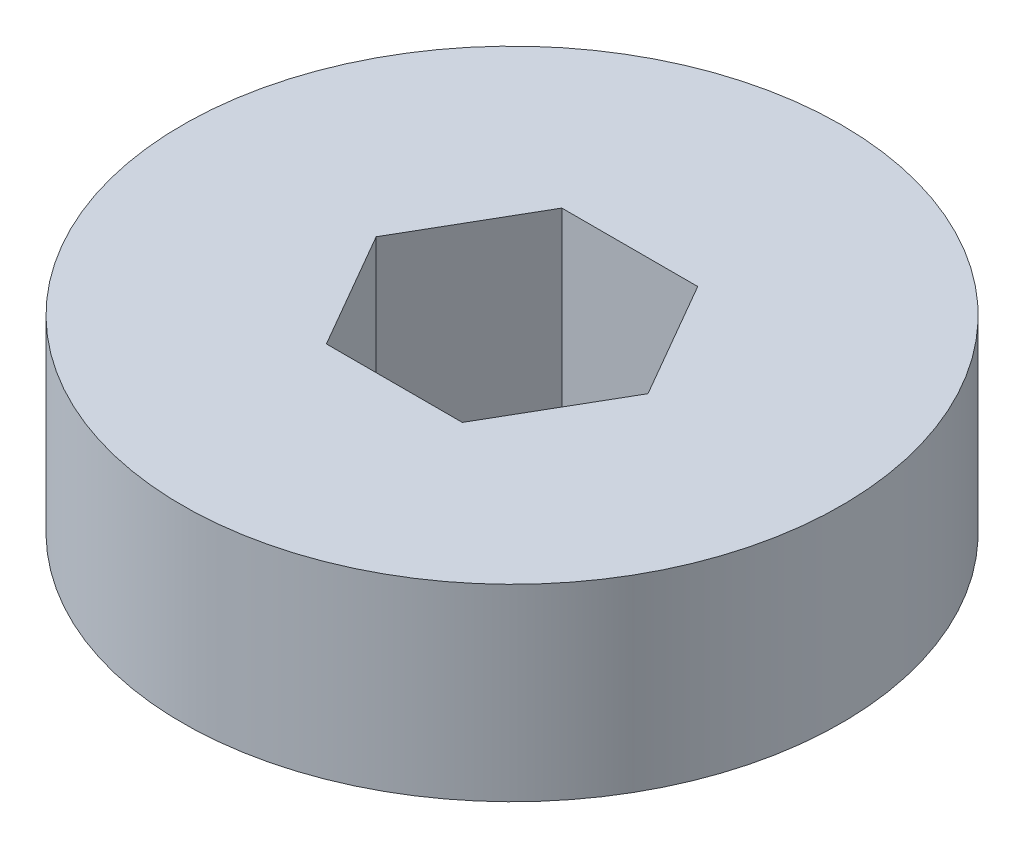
ISO-10303-21;
HEADER;
FILE_DESCRIPTION(('STEP AP214'),'2;1');
FILE_NAME('part.step','',(''),(''),'','','');
FILE_SCHEMA(('AUTOMOTIVE_DESIGN { 1 0 10303 214 1 1 1 1 }'));
ENDSEC;
DATA;
#1=APPLICATION_CONTEXT('core data for automotive mechanical design processes');
#2=APPLICATION_PROTOCOL_DEFINITION('international standard','automotive_design',2000,#1);
#3=PRODUCT_CONTEXT('',#1,'mechanical');
#4=PRODUCT('Part','Part','',(#3));
#5=PRODUCT_RELATED_PRODUCT_CATEGORY('part','',(#4));
#6=PRODUCT_DEFINITION_FORMATION('','',#4);
#7=PRODUCT_DEFINITION_CONTEXT('part definition',#1,'design');
#8=PRODUCT_DEFINITION('design','',#6,#7);
#9=PRODUCT_DEFINITION_SHAPE('','',#8);
#10=(LENGTH_UNIT() NAMED_UNIT(*) SI_UNIT(.MILLI.,.METRE.));
#11=(NAMED_UNIT(*) PLANE_ANGLE_UNIT() SI_UNIT($,.RADIAN.));
#12=(NAMED_UNIT(*) SI_UNIT($,.STERADIAN.) SOLID_ANGLE_UNIT());
#13=UNCERTAINTY_MEASURE_WITH_UNIT(LENGTH_MEASURE(1.E-05),#10,'distance_accuracy_value','');
#14=(GEOMETRIC_REPRESENTATION_CONTEXT(3) GLOBAL_UNCERTAINTY_ASSIGNED_CONTEXT((#13)) GLOBAL_UNIT_ASSIGNED_CONTEXT((#10,
#11,#12)) REPRESENTATION_CONTEXT('',''));
#15=CARTESIAN_POINT('',(0.,0.,0.));
#16=DIRECTION('',(0.,0.,1.));
#17=DIRECTION('',(1.,0.,0.));
#18=AXIS2_PLACEMENT_3D('',#15,#16,#17);
#19=CARTESIAN_POINT('',(56.,154.,66.));
#20=DIRECTION('',(0.,-1.,0.));
#21=DIRECTION('',(0.,0.,-1.));
#22=AXIS2_PLACEMENT_3D('',#19,#20,#21);
#23=CYLINDRICAL_SURFACE('',#22,7.);
#24=CARTESIAN_POINT('',(56.,150.,66.));
#25=DIRECTION('',(0.,-1.,0.));
#26=DIRECTION('',(0.,0.,-1.));
#27=AXIS2_PLACEMENT_3D('',#24,#25,#26);
#28=CIRCLE('',#27,7.);
#29=CARTESIAN_POINT('',(56.,150.,59.));
#30=VERTEX_POINT('',#29);
#31=EDGE_CURVE('E102',#30,#30,#28,.T.);
#32=ORIENTED_EDGE('',*,*,#31,.F.);
#33=EDGE_LOOP('',(#32));
#34=FACE_BOUND('',#33,.T.);
#35=CARTESIAN_POINT('',(56.,154.,66.));
#36=DIRECTION('',(0.,-1.,0.));
#37=DIRECTION('',(0.,0.,-1.));
#38=AXIS2_PLACEMENT_3D('',#35,#36,#37);
#39=CIRCLE('',#38,7.);
#40=CARTESIAN_POINT('',(56.,154.,59.));
#41=VERTEX_POINT('',#40);
#42=EDGE_CURVE('E112',#41,#41,#39,.F.);
#43=ORIENTED_EDGE('',*,*,#42,.F.);
#44=EDGE_LOOP('',(#43));
#45=FACE_BOUND('',#44,.T.);
#46=ADVANCED_FACE('F16',(#34,#45),#23,.T.);
#47=CARTESIAN_POINT('',(53.8349364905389,152.,67.25));
#48=DIRECTION('',(0.866025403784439,0.,-0.499999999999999));
#49=DIRECTION('',(-0.499999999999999,0.,-0.866025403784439));
#50=AXIS2_PLACEMENT_3D('',#47,#48,#49);
#51=PLANE('',#50);
#52=DIRECTION('',(0.,1.,0.));
#53=VECTOR('',#52,1.);
#54=CARTESIAN_POINT('',(53.1132486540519,152.,66.));
#55=LINE('',#54,#53);
#56=CARTESIAN_POINT('',(53.1132486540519,154.,66.));
#57=VERTEX_POINT('',#56);
#58=CARTESIAN_POINT('',(53.1132486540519,150.,66.));
#59=VERTEX_POINT('',#58);
#60=EDGE_CURVE('E87',#57,#59,#55,.F.);
#61=ORIENTED_EDGE('',*,*,#60,.F.);
#62=DIRECTION('',(-0.499999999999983,0.,-0.866025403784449));
#63=VECTOR('',#62,1.);
#64=CARTESIAN_POINT('',(54.5566243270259,154.,68.5));
#65=LINE('',#64,#63);
#66=CARTESIAN_POINT('',(54.5566243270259,154.,68.5));
#67=VERTEX_POINT('',#66);
#68=EDGE_CURVE('E68',#67,#57,#65,.T.);
#69=ORIENTED_EDGE('',*,*,#68,.F.);
#70=DIRECTION('',(0.,1.,0.));
#71=VECTOR('',#70,1.);
#72=CARTESIAN_POINT('',(54.5566243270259,152.,68.5));
#73=LINE('',#72,#71);
#74=CARTESIAN_POINT('',(54.5566243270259,150.,68.5));
#75=VERTEX_POINT('',#74);
#76=EDGE_CURVE('E89',#75,#67,#73,.T.);
#77=ORIENTED_EDGE('',*,*,#76,.F.);
#78=DIRECTION('',(0.499999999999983,0.,0.866025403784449));
#79=VECTOR('',#78,1.);
#80=CARTESIAN_POINT('',(53.1132486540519,150.,66.));
#81=LINE('',#80,#79);
#82=EDGE_CURVE('E84',#59,#75,#81,.T.);
#83=ORIENTED_EDGE('',*,*,#82,.F.);
#84=EDGE_LOOP('',(#61,#69,#77,#83));
#85=FACE_BOUND('',#84,.T.);
#86=ADVANCED_FACE('F86',(#85),#51,.T.);
#87=CARTESIAN_POINT('',(53.8349364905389,152.,64.75));
#88=DIRECTION('',(0.866025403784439,0.,0.499999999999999));
#89=DIRECTION('',(0.499999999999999,0.,-0.866025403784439));
#90=AXIS2_PLACEMENT_3D('',#87,#88,#89);
#91=PLANE('',#90);
#92=DIRECTION('',(0.,1.,0.));
#93=VECTOR('',#92,1.);
#94=CARTESIAN_POINT('',(54.5566243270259,152.,63.5));
#95=LINE('',#94,#93);
#96=CARTESIAN_POINT('',(54.5566243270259,154.,63.5));
#97=VERTEX_POINT('',#96);
#98=CARTESIAN_POINT('',(54.5566243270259,150.,63.5));
#99=VERTEX_POINT('',#98);
#100=EDGE_CURVE('E79',#97,#99,#95,.F.);
#101=ORIENTED_EDGE('',*,*,#100,.F.);
#102=DIRECTION('',(0.499999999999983,0.,-0.866025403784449));
#103=VECTOR('',#102,1.);
#104=CARTESIAN_POINT('',(53.1132486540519,154.,66.));
#105=LINE('',#104,#103);
#106=EDGE_CURVE('E97',#57,#97,#105,.T.);
#107=ORIENTED_EDGE('',*,*,#106,.F.);
#108=ORIENTED_EDGE('',*,*,#60,.T.);
#109=DIRECTION('',(-0.499999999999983,0.,0.866025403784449));
#110=VECTOR('',#109,1.);
#111=CARTESIAN_POINT('',(54.5566243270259,150.,63.5));
#112=LINE('',#111,#110);
#113=EDGE_CURVE('E94',#99,#59,#112,.T.);
#114=ORIENTED_EDGE('',*,*,#113,.F.);
#115=EDGE_LOOP('',(#101,#107,#108,#114));
#116=FACE_BOUND('',#115,.T.);
#117=ADVANCED_FACE('F93',(#116),#91,.T.);
#118=CARTESIAN_POINT('',(56.,152.,68.5));
#119=DIRECTION('',(0.,0.,-1.));
#120=DIRECTION('',(-1.,0.,0.));
#121=AXIS2_PLACEMENT_3D('',#118,#119,#120);
#122=PLANE('',#121);
#123=ORIENTED_EDGE('',*,*,#76,.T.);
#124=DIRECTION('',(1.,0.,0.));
#125=VECTOR('',#124,1.);
#126=CARTESIAN_POINT('',(56.,154.,68.5));
#127=LINE('',#126,#125);
#128=CARTESIAN_POINT('',(57.4433756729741,154.,68.5));
#129=VERTEX_POINT('',#128);
#130=EDGE_CURVE('E114',#129,#67,#127,.F.);
#131=ORIENTED_EDGE('',*,*,#130,.F.);
#132=DIRECTION('',(0.,1.,0.));
#133=VECTOR('',#132,1.);
#134=CARTESIAN_POINT('',(57.4433756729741,152.,68.5));
#135=LINE('',#134,#133);
#136=CARTESIAN_POINT('',(57.4433756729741,150.,68.5));
#137=VERTEX_POINT('',#136);
#138=EDGE_CURVE('E55',#137,#129,#135,.T.);
#139=ORIENTED_EDGE('',*,*,#138,.F.);
#140=DIRECTION('',(1.,0.,0.));
#141=VECTOR('',#140,1.);
#142=CARTESIAN_POINT('',(56.,150.,68.5));
#143=LINE('',#142,#141);
#144=EDGE_CURVE('E75',#75,#137,#143,.T.);
#145=ORIENTED_EDGE('',*,*,#144,.F.);
#146=EDGE_LOOP('',(#123,#131,#139,#145));
#147=FACE_BOUND('',#146,.T.);
#148=ADVANCED_FACE('F162',(#147),#122,.T.);
#149=CARTESIAN_POINT('',(56.,152.,63.5));
#150=DIRECTION('',(0.,0.,1.));
#151=DIRECTION('',(1.,0.,0.));
#152=AXIS2_PLACEMENT_3D('',#149,#150,#151);
#153=PLANE('',#152);
#154=DIRECTION('',(0.,1.,0.));
#155=VECTOR('',#154,1.);
#156=CARTESIAN_POINT('',(57.4433756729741,152.,63.5));
#157=LINE('',#156,#155);
#158=CARTESIAN_POINT('',(57.4433756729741,154.,63.5));
#159=VERTEX_POINT('',#158);
#160=CARTESIAN_POINT('',(57.4433756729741,150.,63.5));
#161=VERTEX_POINT('',#160);
#162=EDGE_CURVE('E49',#159,#161,#157,.F.);
#163=ORIENTED_EDGE('',*,*,#162,.F.);
#164=DIRECTION('',(1.,0.,0.));
#165=VECTOR('',#164,1.);
#166=CARTESIAN_POINT('',(56.,154.,63.5));
#167=LINE('',#166,#165);
#168=EDGE_CURVE('E118',#97,#159,#167,.T.);
#169=ORIENTED_EDGE('',*,*,#168,.F.);
#170=ORIENTED_EDGE('',*,*,#100,.T.);
#171=DIRECTION('',(1.,0.,0.));
#172=VECTOR('',#171,1.);
#173=CARTESIAN_POINT('',(56.,150.,63.5));
#174=LINE('',#173,#172);
#175=EDGE_CURVE('E101',#161,#99,#174,.F.);
#176=ORIENTED_EDGE('',*,*,#175,.F.);
#177=EDGE_LOOP('',(#163,#169,#170,#176));
#178=FACE_BOUND('',#177,.T.);
#179=ADVANCED_FACE('F156',(#178),#153,.T.);
#180=CARTESIAN_POINT('',(56.,150.,66.));
#181=DIRECTION('',(0.,-1.,0.));
#182=DIRECTION('',(0.,0.,-1.));
#183=AXIS2_PLACEMENT_3D('',#180,#181,#182);
#184=PLANE('',#183);
#185=ORIENTED_EDGE('',*,*,#31,.T.);
#186=EDGE_LOOP('',(#185));
#187=FACE_BOUND('',#186,.T.);
#188=ORIENTED_EDGE('',*,*,#175,.T.);
#189=ORIENTED_EDGE('',*,*,#113,.T.);
#190=ORIENTED_EDGE('',*,*,#82,.T.);
#191=ORIENTED_EDGE('',*,*,#144,.T.);
#192=DIRECTION('',(-0.499999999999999,0.,0.866025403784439));
#193=VECTOR('',#192,1.);
#194=CARTESIAN_POINT('',(58.1650635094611,150.,67.25));
#195=LINE('',#194,#193);
#196=CARTESIAN_POINT('',(58.8867513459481,150.,66.));
#197=VERTEX_POINT('',#196);
#198=EDGE_CURVE('E105',#197,#137,#195,.T.);
#199=ORIENTED_EDGE('',*,*,#198,.F.);
#200=DIRECTION('',(0.499999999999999,0.,0.866025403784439));
#201=VECTOR('',#200,1.);
#202=CARTESIAN_POINT('',(58.1650635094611,150.,64.75));
#203=LINE('',#202,#201);
#204=EDGE_CURVE('E124',#161,#197,#203,.T.);
#205=ORIENTED_EDGE('',*,*,#204,.F.);
#206=EDGE_LOOP('',(#188,#189,#190,#191,#199,#205));
#207=FACE_BOUND('',#206,.T.);
#208=ADVANCED_FACE('F99',(#187,#207),#184,.T.);
#209=CARTESIAN_POINT('',(58.1650635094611,152.,67.25));
#210=DIRECTION('',(-0.866025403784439,0.,-0.499999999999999));
#211=DIRECTION('',(-0.499999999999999,0.,0.866025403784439));
#212=AXIS2_PLACEMENT_3D('',#209,#210,#211);
#213=PLANE('',#212);
#214=ORIENTED_EDGE('',*,*,#138,.T.);
#215=DIRECTION('',(-0.499999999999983,0.,0.866025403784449));
#216=VECTOR('',#215,1.);
#217=CARTESIAN_POINT('',(58.8867513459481,154.,66.));
#218=LINE('',#217,#216);
#219=CARTESIAN_POINT('',(58.8867513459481,154.,66.));
#220=VERTEX_POINT('',#219);
#221=EDGE_CURVE('E35',#220,#129,#218,.T.);
#222=ORIENTED_EDGE('',*,*,#221,.F.);
#223=DIRECTION('',(0.,1.,0.));
#224=VECTOR('',#223,1.);
#225=CARTESIAN_POINT('',(58.8867513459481,152.,66.));
#226=LINE('',#225,#224);
#227=EDGE_CURVE('E26',#197,#220,#226,.T.);
#228=ORIENTED_EDGE('',*,*,#227,.F.);
#229=ORIENTED_EDGE('',*,*,#198,.T.);
#230=EDGE_LOOP('',(#214,#222,#228,#229));
#231=FACE_BOUND('',#230,.T.);
#232=ADVANCED_FACE('F149',(#231),#213,.T.);
#233=CARTESIAN_POINT('',(56.,154.,66.));
#234=DIRECTION('',(0.,1.,0.));
#235=DIRECTION('',(0.,0.,1.));
#236=AXIS2_PLACEMENT_3D('',#233,#234,#235);
#237=PLANE('',#236);
#238=ORIENTED_EDGE('',*,*,#221,.T.);
#239=ORIENTED_EDGE('',*,*,#130,.T.);
#240=ORIENTED_EDGE('',*,*,#68,.T.);
#241=ORIENTED_EDGE('',*,*,#106,.T.);
#242=ORIENTED_EDGE('',*,*,#168,.T.);
#243=DIRECTION('',(0.499999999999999,0.,0.866025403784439));
#244=VECTOR('',#243,1.);
#245=CARTESIAN_POINT('',(58.1650635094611,154.,64.75));
#246=LINE('',#245,#244);
#247=EDGE_CURVE('E11',#220,#159,#246,.F.);
#248=ORIENTED_EDGE('',*,*,#247,.F.);
#249=EDGE_LOOP('',(#238,#239,#240,#241,#242,#248));
#250=FACE_BOUND('',#249,.T.);
#251=ORIENTED_EDGE('',*,*,#42,.T.);
#252=EDGE_LOOP('',(#251));
#253=FACE_BOUND('',#252,.T.);
#254=ADVANCED_FACE('F133',(#250,#253),#237,.T.);
#255=CARTESIAN_POINT('',(58.1650635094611,152.,64.75));
#256=DIRECTION('',(-0.866025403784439,0.,0.499999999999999));
#257=DIRECTION('',(0.499999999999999,0.,0.866025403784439));
#258=AXIS2_PLACEMENT_3D('',#255,#256,#257);
#259=PLANE('',#258);
#260=ORIENTED_EDGE('',*,*,#227,.T.);
#261=ORIENTED_EDGE('',*,*,#247,.T.);
#262=ORIENTED_EDGE('',*,*,#162,.T.);
#263=ORIENTED_EDGE('',*,*,#204,.T.);
#264=EDGE_LOOP('',(#260,#261,#262,#263));
#265=FACE_BOUND('',#264,.T.);
#266=ADVANCED_FACE('F18',(#265),#259,.T.);
#267=CLOSED_SHELL('',(#46,#86,#117,#148,#179,#208,#232,#254,#266));
#268=MANIFOLD_SOLID_BREP('B1',#267);
#269=ADVANCED_BREP_SHAPE_REPRESENTATION('',(#18,#268),#14);
#270=SHAPE_DEFINITION_REPRESENTATION(#9,#269);
ENDSEC;
END-ISO-10303-21;
